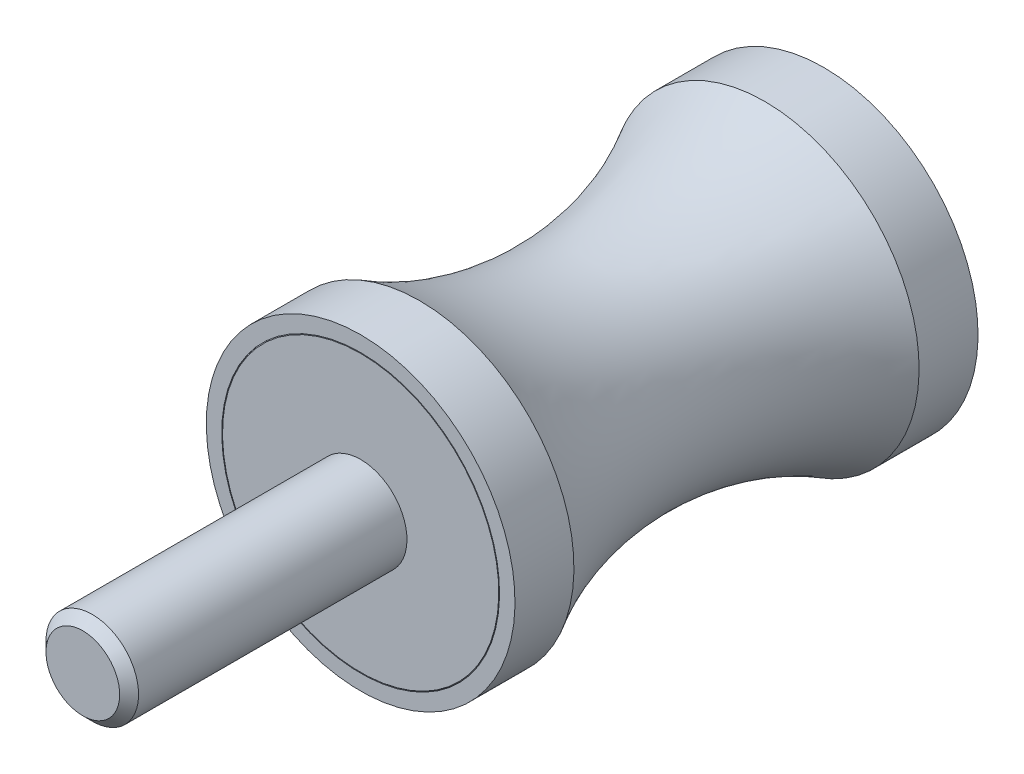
ISO-10303-21;
HEADER;
FILE_DESCRIPTION(('STEP AP214'),'2;1');
FILE_NAME('part.step','',(''),(''),'','','');
FILE_SCHEMA(('AUTOMOTIVE_DESIGN { 1 0 10303 214 1 1 1 1 }'));
ENDSEC;
DATA;
#1=APPLICATION_CONTEXT('core data for automotive mechanical design processes');
#2=APPLICATION_PROTOCOL_DEFINITION('international standard','automotive_design',2000,#1);
#3=PRODUCT_CONTEXT('',#1,'mechanical');
#4=PRODUCT('Part','Part','',(#3));
#5=PRODUCT_RELATED_PRODUCT_CATEGORY('part','',(#4));
#6=PRODUCT_DEFINITION_FORMATION('','',#4);
#7=PRODUCT_DEFINITION_CONTEXT('part definition',#1,'design');
#8=PRODUCT_DEFINITION('design','',#6,#7);
#9=PRODUCT_DEFINITION_SHAPE('','',#8);
#10=(LENGTH_UNIT() NAMED_UNIT(*) SI_UNIT(.MILLI.,.METRE.));
#11=(NAMED_UNIT(*) PLANE_ANGLE_UNIT() SI_UNIT($,.RADIAN.));
#12=(NAMED_UNIT(*) SI_UNIT($,.STERADIAN.) SOLID_ANGLE_UNIT());
#13=UNCERTAINTY_MEASURE_WITH_UNIT(LENGTH_MEASURE(1.E-05),#10,'distance_accuracy_value','');
#14=(GEOMETRIC_REPRESENTATION_CONTEXT(3) GLOBAL_UNCERTAINTY_ASSIGNED_CONTEXT((#13)) GLOBAL_UNIT_ASSIGNED_CONTEXT((#10,
#11,#12)) REPRESENTATION_CONTEXT('',''));
#15=CARTESIAN_POINT('',(0.,0.,0.));
#16=DIRECTION('',(0.,0.,1.));
#17=DIRECTION('',(1.,0.,0.));
#18=AXIS2_PLACEMENT_3D('',#15,#16,#17);
#19=CARTESIAN_POINT('',(0.,0.,0.5));
#20=DIRECTION('',(0.,0.,-1.));
#21=DIRECTION('',(0.,1.,0.));
#22=AXIS2_PLACEMENT_3D('',#19,#20,#21);
#23=CYLINDRICAL_SURFACE('',#22,9.);
#24=CARTESIAN_POINT('',(0.,0.,0.05));
#25=DIRECTION('',(0.,0.,-1.));
#26=DIRECTION('',(0.,1.,0.));
#27=AXIS2_PLACEMENT_3D('',#24,#25,#26);
#28=CIRCLE('',#27,9.);
#29=CARTESIAN_POINT('',(0.,9.,0.05));
#30=VERTEX_POINT('',#29);
#31=EDGE_CURVE('E53',#30,#30,#28,.T.);
#32=ORIENTED_EDGE('',*,*,#31,.F.);
#33=EDGE_LOOP('',(#32));
#34=FACE_BOUND('',#33,.T.);
#35=CARTESIAN_POINT('',(0.,0.,0.));
#36=DIRECTION('',(0.,0.,-1.));
#37=DIRECTION('',(0.,1.,0.));
#38=AXIS2_PLACEMENT_3D('',#35,#36,#37);
#39=CIRCLE('',#38,9.);
#40=CARTESIAN_POINT('',(0.,9.,0.));
#41=VERTEX_POINT('',#40);
#42=EDGE_CURVE('E44',#41,#41,#39,.T.);
#43=ORIENTED_EDGE('',*,*,#42,.T.);
#44=EDGE_LOOP('',(#43));
#45=FACE_BOUND('',#44,.T.);
#46=ADVANCED_FACE('F12',(#34,#45),#23,.F.);
#47=CARTESIAN_POINT('',(0.,0.,0.5));
#48=DIRECTION('',(0.,0.,-1.));
#49=DIRECTION('',(0.,1.,0.));
#50=AXIS2_PLACEMENT_3D('',#47,#48,#49);
#51=CYLINDRICAL_SURFACE('',#50,9.);
#52=CARTESIAN_POINT('',(0.,0.,30.));
#53=DIRECTION('',(0.,0.,-1.));
#54=DIRECTION('',(0.,1.,0.));
#55=AXIS2_PLACEMENT_3D('',#52,#53,#54);
#56=CIRCLE('',#55,9.);
#57=CARTESIAN_POINT('',(0.,9.,30.));
#58=VERTEX_POINT('',#57);
#59=EDGE_CURVE('E27',#58,#58,#56,.T.);
#60=ORIENTED_EDGE('',*,*,#59,.F.);
#61=EDGE_LOOP('',(#60));
#62=FACE_BOUND('',#61,.T.);
#63=CARTESIAN_POINT('',(0.,0.,29.95));
#64=DIRECTION('',(0.,0.,-1.));
#65=DIRECTION('',(0.,1.,0.));
#66=AXIS2_PLACEMENT_3D('',#63,#64,#65);
#67=CIRCLE('',#66,9.);
#68=CARTESIAN_POINT('',(0.,9.,29.95));
#69=VERTEX_POINT('',#68);
#70=EDGE_CURVE('E50',#69,#69,#67,.T.);
#71=ORIENTED_EDGE('',*,*,#70,.T.);
#72=EDGE_LOOP('',(#71));
#73=FACE_BOUND('',#72,.T.);
#74=ADVANCED_FACE('F89',(#62,#73),#51,.F.);
#75=CARTESIAN_POINT('',(9.,0.,30.));
#76=DIRECTION('',(0.,0.,-1.));
#77=DIRECTION('',(0.,1.,0.));
#78=AXIS2_PLACEMENT_3D('',#75,#76,#77);
#79=PLANE('',#78);
#80=CARTESIAN_POINT('',(0.,0.,30.));
#81=DIRECTION('',(0.,0.,-1.));
#82=DIRECTION('',(0.,1.,0.));
#83=AXIS2_PLACEMENT_3D('',#80,#81,#82);
#84=CIRCLE('',#83,10.);
#85=CARTESIAN_POINT('',(0.,10.,30.));
#86=VERTEX_POINT('',#85);
#87=EDGE_CURVE('E32',#86,#86,#84,.T.);
#88=ORIENTED_EDGE('',*,*,#87,.F.);
#89=EDGE_LOOP('',(#88));
#90=FACE_BOUND('',#89,.T.);
#91=ORIENTED_EDGE('',*,*,#59,.T.);
#92=EDGE_LOOP('',(#91));
#93=FACE_BOUND('',#92,.T.);
#94=ADVANCED_FACE('F115',(#90,#93),#79,.F.);
#95=CARTESIAN_POINT('',(0.,0.,0.5));
#96=DIRECTION('',(0.,0.,-1.));
#97=DIRECTION('',(0.,1.,0.));
#98=AXIS2_PLACEMENT_3D('',#95,#96,#97);
#99=CYLINDRICAL_SURFACE('',#98,10.);
#100=CARTESIAN_POINT('',(0.,0.,26.1803398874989));
#101=DIRECTION('',(0.,0.,-1.));
#102=DIRECTION('',(0.,1.,0.));
#103=AXIS2_PLACEMENT_3D('',#100,#101,#102);
#104=CIRCLE('',#103,10.);
#105=CARTESIAN_POINT('',(0.,10.,26.1803398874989));
#106=VERTEX_POINT('',#105);
#107=EDGE_CURVE('E35',#106,#106,#104,.T.);
#108=ORIENTED_EDGE('',*,*,#107,.F.);
#109=EDGE_LOOP('',(#108));
#110=FACE_BOUND('',#109,.T.);
#111=ORIENTED_EDGE('',*,*,#87,.T.);
#112=EDGE_LOOP('',(#111));
#113=FACE_BOUND('',#112,.T.);
#114=ADVANCED_FACE('F109',(#110,#113),#99,.T.);
#115=CARTESIAN_POINT('',(0.,0.,15.));
#116=DIRECTION('',(0.,0.,-1.));
#117=DIRECTION('',(0.,1.,0.));
#118=AXIS2_PLACEMENT_3D('',#115,#116,#117);
#119=TOROIDAL_SURFACE('',#118,29.3333333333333,22.3333333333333);
#120=CARTESIAN_POINT('',(0.,0.,3.81966011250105));
#121=DIRECTION('',(0.,0.,-1.));
#122=DIRECTION('',(0.,1.,0.));
#123=AXIS2_PLACEMENT_3D('',#120,#121,#122);
#124=CIRCLE('',#123,10.);
#125=CARTESIAN_POINT('',(0.,10.,3.81966011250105));
#126=VERTEX_POINT('',#125);
#127=EDGE_CURVE('E38',#126,#126,#124,.T.);
#128=ORIENTED_EDGE('',*,*,#127,.F.);
#129=EDGE_LOOP('',(#128));
#130=FACE_BOUND('',#129,.T.);
#131=ORIENTED_EDGE('',*,*,#107,.T.);
#132=EDGE_LOOP('',(#131));
#133=FACE_BOUND('',#132,.T.);
#134=ADVANCED_FACE('F103',(#130,#133),#119,.F.);
#135=CARTESIAN_POINT('',(0.,0.,0.5));
#136=DIRECTION('',(0.,0.,-1.));
#137=DIRECTION('',(0.,1.,0.));
#138=AXIS2_PLACEMENT_3D('',#135,#136,#137);
#139=CYLINDRICAL_SURFACE('',#138,10.);
#140=CARTESIAN_POINT('',(0.,0.,0.));
#141=DIRECTION('',(0.,0.,-1.));
#142=DIRECTION('',(0.,1.,0.));
#143=AXIS2_PLACEMENT_3D('',#140,#141,#142);
#144=CIRCLE('',#143,10.);
#145=CARTESIAN_POINT('',(0.,10.,0.));
#146=VERTEX_POINT('',#145);
#147=EDGE_CURVE('E41',#146,#146,#144,.T.);
#148=ORIENTED_EDGE('',*,*,#147,.F.);
#149=EDGE_LOOP('',(#148));
#150=FACE_BOUND('',#149,.T.);
#151=ORIENTED_EDGE('',*,*,#127,.T.);
#152=EDGE_LOOP('',(#151));
#153=FACE_BOUND('',#152,.T.);
#154=ADVANCED_FACE('F97',(#150,#153),#139,.T.);
#155=CARTESIAN_POINT('',(10.,0.,0.));
#156=DIRECTION('',(0.,0.,1.));
#157=DIRECTION('',(0.,-1.,0.));
#158=AXIS2_PLACEMENT_3D('',#155,#156,#157);
#159=PLANE('',#158);
#160=ORIENTED_EDGE('',*,*,#42,.F.);
#161=EDGE_LOOP('',(#160));
#162=FACE_BOUND('',#161,.T.);
#163=ORIENTED_EDGE('',*,*,#147,.T.);
#164=EDGE_LOOP('',(#163));
#165=FACE_BOUND('',#164,.T.);
#166=ADVANCED_FACE('F93',(#162,#165),#159,.F.);
#167=CARTESIAN_POINT('',(0.,0.,30.));
#168=DIRECTION('',(0.,0.,-1.));
#169=DIRECTION('',(0.,1.,0.));
#170=AXIS2_PLACEMENT_3D('',#167,#168,#169);
#171=PLANE('',#170);
#172=CARTESIAN_POINT('',(0.,0.,30.));
#173=DIRECTION('',(0.,0.,-1.));
#174=DIRECTION('',(0.,1.,0.));
#175=AXIS2_PLACEMENT_3D('',#172,#173,#174);
#176=CIRCLE('',#175,8.95);
#177=CARTESIAN_POINT('',(0.,8.95,30.));
#178=VERTEX_POINT('',#177);
#179=EDGE_CURVE('E47',#178,#178,#176,.T.);
#180=ORIENTED_EDGE('',*,*,#179,.F.);
#181=EDGE_LOOP('',(#180));
#182=FACE_BOUND('',#181,.T.);
#183=CARTESIAN_POINT('',(0.,0.,30.));
#184=DIRECTION('',(0.,0.,-1.));
#185=DIRECTION('',(0.,1.,0.));
#186=AXIS2_PLACEMENT_3D('',#183,#184,#185);
#187=CIRCLE('',#186,3.);
#188=CARTESIAN_POINT('',(0.,3.,30.));
#189=VERTEX_POINT('',#188);
#190=EDGE_CURVE('E8',#189,#189,#187,.T.);
#191=ORIENTED_EDGE('',*,*,#190,.T.);
#192=EDGE_LOOP('',(#191));
#193=FACE_BOUND('',#192,.T.);
#194=ADVANCED_FACE('F96',(#182,#193),#171,.F.);
#195=CARTESIAN_POINT('',(0.,0.,30.));
#196=DIRECTION('',(0.,0.,-1.));
#197=DIRECTION('',(0.,1.,0.));
#198=AXIS2_PLACEMENT_3D('',#195,#196,#197);
#199=CONICAL_SURFACE('',#198,8.95,0.7853981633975);
#200=ORIENTED_EDGE('',*,*,#70,.F.);
#201=EDGE_LOOP('',(#200));
#202=FACE_BOUND('',#201,.T.);
#203=ORIENTED_EDGE('',*,*,#179,.T.);
#204=EDGE_LOOP('',(#203));
#205=FACE_BOUND('',#204,.T.);
#206=ADVANCED_FACE('F129',(#202,#205),#199,.T.);
#207=CARTESIAN_POINT('',(0.,0.,48.));
#208=DIRECTION('',(0.,0.,-1.));
#209=DIRECTION('',(0.,1.,0.));
#210=AXIS2_PLACEMENT_3D('',#207,#208,#209);
#211=PLANE('',#210);
#212=CARTESIAN_POINT('',(0.,0.,48.));
#213=DIRECTION('',(0.,0.,-1.));
#214=DIRECTION('',(0.,1.,0.));
#215=AXIS2_PLACEMENT_3D('',#212,#213,#214);
#216=CIRCLE('',#215,2.3865);
#217=CARTESIAN_POINT('',(0.,2.3865,48.));
#218=VERTEX_POINT('',#217);
#219=EDGE_CURVE('E19',#218,#218,#216,.T.);
#220=ORIENTED_EDGE('',*,*,#219,.F.);
#221=EDGE_LOOP('',(#220));
#222=FACE_BOUND('',#221,.T.);
#223=ADVANCED_FACE('F14',(#222),#211,.F.);
#224=CARTESIAN_POINT('',(0.,0.,48.));
#225=DIRECTION('',(0.,0.,-1.));
#226=DIRECTION('',(0.,1.,0.));
#227=AXIS2_PLACEMENT_3D('',#224,#225,#226);
#228=CONICAL_SURFACE('',#227,2.3865,0.785398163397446);
#229=CARTESIAN_POINT('',(0.,0.,47.3865));
#230=DIRECTION('',(0.,0.,-1.));
#231=DIRECTION('',(0.,1.,0.));
#232=AXIS2_PLACEMENT_3D('',#229,#230,#231);
#233=CIRCLE('',#232,3.);
#234=CARTESIAN_POINT('',(0.,3.,47.3865));
#235=VERTEX_POINT('',#234);
#236=EDGE_CURVE('E23',#235,#235,#233,.T.);
#237=ORIENTED_EDGE('',*,*,#236,.F.);
#238=EDGE_LOOP('',(#237));
#239=FACE_BOUND('',#238,.T.);
#240=ORIENTED_EDGE('',*,*,#219,.T.);
#241=EDGE_LOOP('',(#240));
#242=FACE_BOUND('',#241,.T.);
#243=ADVANCED_FACE('F142',(#239,#242),#228,.T.);
#244=CARTESIAN_POINT('',(0.,0.,0.5));
#245=DIRECTION('',(0.,0.,-1.));
#246=DIRECTION('',(0.,1.,0.));
#247=AXIS2_PLACEMENT_3D('',#244,#245,#246);
#248=CYLINDRICAL_SURFACE('',#247,3.);
#249=ORIENTED_EDGE('',*,*,#190,.F.);
#250=EDGE_LOOP('',(#249));
#251=FACE_BOUND('',#250,.T.);
#252=ORIENTED_EDGE('',*,*,#236,.T.);
#253=EDGE_LOOP('',(#252));
#254=FACE_BOUND('',#253,.T.);
#255=ADVANCED_FACE('F83',(#251,#254),#248,.T.);
#256=CARTESIAN_POINT('',(0.,0.,0.05));
#257=DIRECTION('',(0.,0.,1.));
#258=DIRECTION('',(0.,-1.,0.));
#259=AXIS2_PLACEMENT_3D('',#256,#257,#258);
#260=CONICAL_SURFACE('',#259,9.,0.785398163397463);
#261=CARTESIAN_POINT('',(0.,0.,0.));
#262=DIRECTION('',(0.,0.,-1.));
#263=DIRECTION('',(0.,1.,0.));
#264=AXIS2_PLACEMENT_3D('',#261,#262,#263);
#265=CIRCLE('',#264,8.95);
#266=CARTESIAN_POINT('',(0.,8.95,0.));
#267=VERTEX_POINT('',#266);
#268=EDGE_CURVE('E56',#267,#267,#265,.T.);
#269=ORIENTED_EDGE('',*,*,#268,.F.);
#270=EDGE_LOOP('',(#269));
#271=FACE_BOUND('',#270,.T.);
#272=ORIENTED_EDGE('',*,*,#31,.T.);
#273=EDGE_LOOP('',(#272));
#274=FACE_BOUND('',#273,.T.);
#275=ADVANCED_FACE('F77',(#271,#274),#260,.T.);
#276=CARTESIAN_POINT('',(8.95,0.,0.));
#277=DIRECTION('',(0.,0.,1.));
#278=DIRECTION('',(0.,-1.,0.));
#279=AXIS2_PLACEMENT_3D('',#276,#277,#278);
#280=PLANE('',#279);
#281=CARTESIAN_POINT('',(0.,0.,0.));
#282=DIRECTION('',(0.,0.,-1.));
#283=DIRECTION('',(0.,1.,0.));
#284=AXIS2_PLACEMENT_3D('',#281,#282,#283);
#285=CIRCLE('',#284,3.);
#286=CARTESIAN_POINT('',(0.,3.,0.));
#287=VERTEX_POINT('',#286);
#288=EDGE_CURVE('E60',#287,#287,#285,.T.);
#289=ORIENTED_EDGE('',*,*,#288,.F.);
#290=EDGE_LOOP('',(#289));
#291=FACE_BOUND('',#290,.T.);
#292=ORIENTED_EDGE('',*,*,#268,.T.);
#293=EDGE_LOOP('',(#292));
#294=FACE_BOUND('',#293,.T.);
#295=ADVANCED_FACE('F71',(#291,#294),#280,.F.);
#296=CARTESIAN_POINT('',(0.,0.,6.));
#297=DIRECTION('',(0.,0.,-1.));
#298=DIRECTION('',(0.,1.,0.));
#299=AXIS2_PLACEMENT_3D('',#296,#297,#298);
#300=CYLINDRICAL_SURFACE('',#299,3.);
#301=CARTESIAN_POINT('',(0.,0.,6.));
#302=DIRECTION('',(0.,0.,-1.));
#303=DIRECTION('',(0.,1.,0.));
#304=AXIS2_PLACEMENT_3D('',#301,#302,#303);
#305=CIRCLE('',#304,3.);
#306=CARTESIAN_POINT('',(0.,3.,6.));
#307=VERTEX_POINT('',#306);
#308=EDGE_CURVE('E59',#307,#307,#305,.T.);
#309=ORIENTED_EDGE('',*,*,#308,.F.);
#310=EDGE_LOOP('',(#309));
#311=FACE_BOUND('',#310,.T.);
#312=ORIENTED_EDGE('',*,*,#288,.T.);
#313=EDGE_LOOP('',(#312));
#314=FACE_BOUND('',#313,.T.);
#315=ADVANCED_FACE('F68',(#311,#314),#300,.F.);
#316=CARTESIAN_POINT('',(0.,0.,6.));
#317=DIRECTION('',(0.,0.,-1.));
#318=DIRECTION('',(0.,1.,0.));
#319=AXIS2_PLACEMENT_3D('',#316,#317,#318);
#320=PLANE('',#319);
#321=ORIENTED_EDGE('',*,*,#308,.T.);
#322=EDGE_LOOP('',(#321));
#323=FACE_BOUND('',#322,.T.);
#324=ADVANCED_FACE('F66',(#323),#320,.T.);
#325=CLOSED_SHELL('',(#46,#74,#94,#114,#134,#154,#166,#194,#206,#223,#243,#255,#275,#295,#315,#324));
#326=MANIFOLD_SOLID_BREP('B1',#325);
#327=ADVANCED_BREP_SHAPE_REPRESENTATION('',(#18,#326),#14);
#328=SHAPE_DEFINITION_REPRESENTATION(#9,#327);
ENDSEC;
END-ISO-10303-21;
